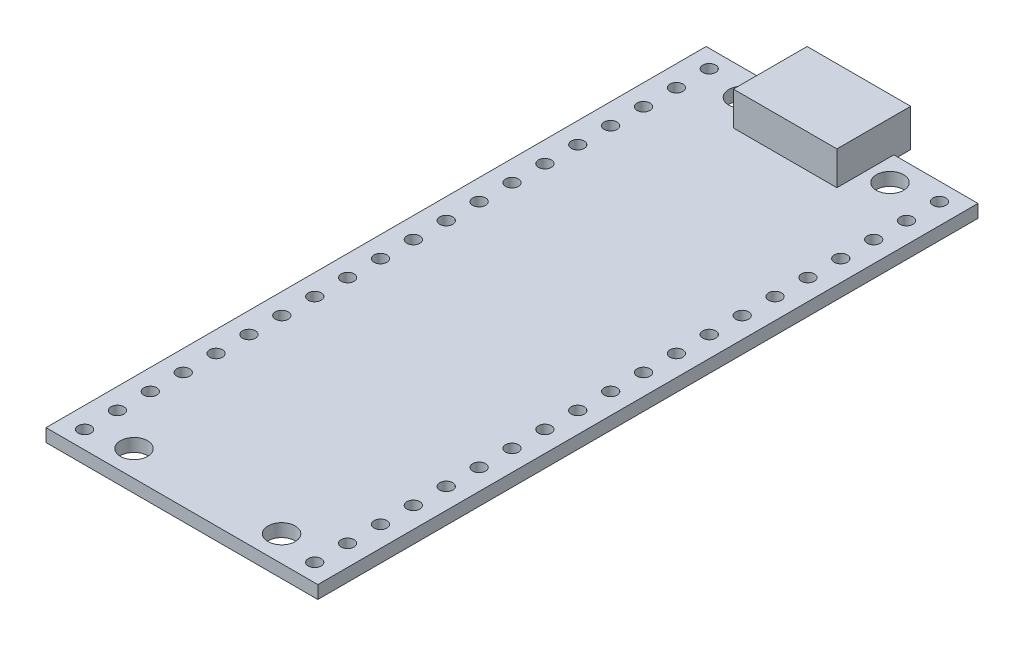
from build123d import *

# Parameters (mm, degrees)
SKETCH1_W                    = 21
SKETCH1_H                    = 51
BOSS_EXTRUDE1_DEPTH          = 1
MOUNTING_HOLES_REACH         = 29.595
SKETCH2_R                    = 1.05
MICRO_USB_OUTLINE_DEPTH      = 2.6
MICRO_USB_OUTLINE_DEPTH_BACK = 0.3
SKETCH3_W                    = 8
SKETCH3_H                    = 5.7
SKETCH4_R                    = 0.5
PIN_1_HOLE_DEPTH             = 29.900692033
EDGE_PINS_COUNT              = 20
EDGE_PINS_PITCH              = 2.54
EDGE_PINS_COUNT_DIR2         = 2
EDGE_PINS_PITCH_DIR2         = 17.78


with BuildPart() as part:
    # Sketch1 → Boss-Extrude1 (new body)
    with BuildSketch(Plane(origin=(0, 0, 0), x_dir=(1, 0, 0), z_dir=(0, 1, 0))):
        Rectangle(SKETCH1_W, SKETCH1_H)
    extrude(amount=BOSS_EXTRUDE1_DEPTH)

    # Sketch2 → mounting holes (cut, up to next)
    with BuildSketch(Plane(origin=(0, 1, 0), x_dir=(1, 0, 0), z_dir=(0, 1, 0)), mode=Mode.PRIVATE) as mounting_holes_sk1:
        with Locations(Location((-5.7, -23.5, 0), (0, 0, 270))):
            Circle(SKETCH2_R)
    mounting_holes_tool1 = extrude(mounting_holes_sk1.sketch, amount=-MOUNTING_HOLES_REACH, mode=Mode.PRIVATE) & part.part
    # Sketch2 → mounting holes (cut, up to next)
    with BuildSketch(Plane(origin=(0, 1, 0), x_dir=(1, 0, 0), z_dir=(0, 1, 0)), mode=Mode.PRIVATE) as mounting_holes_sk2:
        with Locations(Location((5.7, -23.5, 0), (0, 0, 270))):
            Circle(SKETCH2_R)
    mounting_holes_tool2 = extrude(mounting_holes_sk2.sketch, amount=-MOUNTING_HOLES_REACH, mode=Mode.PRIVATE) & part.part
    # Sketch2 → mounting holes (cut, up to next)
    with BuildSketch(Plane(origin=(0, 1, 0), x_dir=(1, 0, 0), z_dir=(0, 1, 0)), mode=Mode.PRIVATE) as mounting_holes_sk3:
        with Locations(Location((-5.7, 23.5, 0), (0, 0, 270))):
            Circle(SKETCH2_R)
    mounting_holes_tool3 = extrude(mounting_holes_sk3.sketch, amount=-MOUNTING_HOLES_REACH, mode=Mode.PRIVATE) & part.part
    # Sketch2 → mounting holes (cut, up to next)
    with BuildSketch(Plane(origin=(0, 1, 0), x_dir=(1, 0, 0), z_dir=(0, 1, 0)), mode=Mode.PRIVATE) as mounting_holes_sk4:
        with Locations(Location((5.7, 23.5, 0), (0, 0, 270))):
            Circle(SKETCH2_R)
    mounting_holes_tool4 = extrude(mounting_holes_sk4.sketch, amount=-MOUNTING_HOLES_REACH, mode=Mode.PRIVATE) & part.part
    add(mounting_holes_tool1.solids().sort_by_distance((-5.7, 1, 23.5))[0], mode=Mode.SUBTRACT)
    add(mounting_holes_tool2.solids().sort_by_distance((5.7, 1, 23.5))[0], mode=Mode.SUBTRACT)
    add(mounting_holes_tool3.solids().sort_by_distance((-5.7, 1, -23.5))[0], mode=Mode.SUBTRACT)
    add(mounting_holes_tool4.solids().sort_by_distance((5.7, 1, -23.5))[0], mode=Mode.SUBTRACT)

    # Sketch3 → micro-USB outline (add, two sides: drawn at the far end of the back side and taken through both)
    with BuildSketch(Plane(origin=(0, 1, 0), x_dir=(1, 0, 0), z_dir=(0, 1, 0)).offset(-MICRO_USB_OUTLINE_DEPTH_BACK)):
        with Locations((0, 23.95)):
            Rectangle(SKETCH3_W, SKETCH3_H)
    extrude(amount=MICRO_USB_OUTLINE_DEPTH + MICRO_USB_OUTLINE_DEPTH_BACK)

    # Sketch4 → pin 1 hole (cut, through all)
    with BuildSketch(Plane(origin=(0, 1, 0), x_dir=(1, 0, 0), z_dir=(0, 1, 0))):
        with Locations(Location((-8.89, 24.13, 0), (0, 0, 270))):
            Circle(SKETCH4_R)
    pin_1_hole = extrude(amount=-PIN_1_HOLE_DEPTH, mode=Mode.SUBTRACT)

    # edge pins: pin 1 hole 20 × 2
    with Locations(*[(j * EDGE_PINS_PITCH_DIR2, 0, i * EDGE_PINS_PITCH) for i in range(EDGE_PINS_COUNT) for j in range(EDGE_PINS_COUNT_DIR2) if (i, j) != (0, 0)]):
        add(pin_1_hole, mode=Mode.SUBTRACT)


solid = part.part
